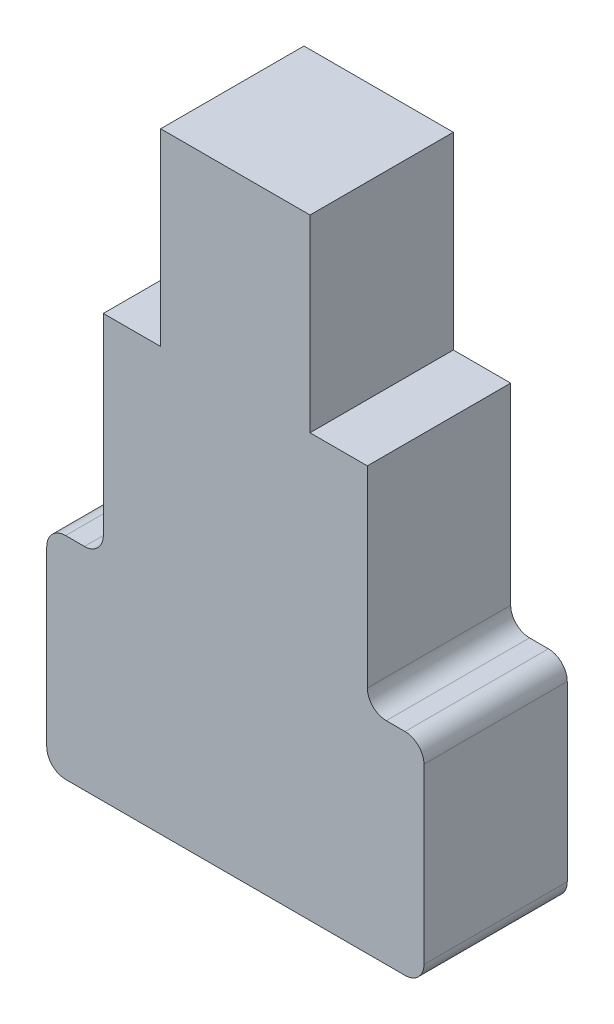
ISO-10303-21;
HEADER;
FILE_DESCRIPTION(('STEP AP214'),'2;1');
FILE_NAME('part.step','',(''),(''),'','','');
FILE_SCHEMA(('AUTOMOTIVE_DESIGN { 1 0 10303 214 1 1 1 1 }'));
ENDSEC;
DATA;
#1=APPLICATION_CONTEXT('core data for automotive mechanical design processes');
#2=APPLICATION_PROTOCOL_DEFINITION('international standard','automotive_design',2000,#1);
#3=PRODUCT_CONTEXT('',#1,'mechanical');
#4=PRODUCT('Part','Part','',(#3));
#5=PRODUCT_RELATED_PRODUCT_CATEGORY('part','',(#4));
#6=PRODUCT_DEFINITION_FORMATION('','',#4);
#7=PRODUCT_DEFINITION_CONTEXT('part definition',#1,'design');
#8=PRODUCT_DEFINITION('design','',#6,#7);
#9=PRODUCT_DEFINITION_SHAPE('','',#8);
#10=(LENGTH_UNIT() NAMED_UNIT(*) SI_UNIT(.MILLI.,.METRE.));
#11=(NAMED_UNIT(*) PLANE_ANGLE_UNIT() SI_UNIT($,.RADIAN.));
#12=(NAMED_UNIT(*) SI_UNIT($,.STERADIAN.) SOLID_ANGLE_UNIT());
#13=UNCERTAINTY_MEASURE_WITH_UNIT(LENGTH_MEASURE(1.E-05),#10,'distance_accuracy_value','');
#14=(GEOMETRIC_REPRESENTATION_CONTEXT(3) GLOBAL_UNCERTAINTY_ASSIGNED_CONTEXT((#13)) GLOBAL_UNIT_ASSIGNED_CONTEXT((#10,
#11,#12)) REPRESENTATION_CONTEXT('',''));
#15=CARTESIAN_POINT('',(0.,0.,0.));
#16=DIRECTION('',(0.,0.,1.));
#17=DIRECTION('',(1.,0.,0.));
#18=AXIS2_PLACEMENT_3D('',#15,#16,#17);
#19=CARTESIAN_POINT('',(-10.02,18.48,9.59));
#20=DIRECTION('',(0.,1.,0.));
#21=DIRECTION('',(0.,0.,1.));
#22=AXIS2_PLACEMENT_3D('',#19,#20,#21);
#23=PLANE('',#22);
#24=DIRECTION('',(0.,0.,-1.));
#25=VECTOR('',#24,1.);
#26=CARTESIAN_POINT('',(-9.77,18.48,9.59));
#27=LINE('',#26,#25);
#28=CARTESIAN_POINT('',(-9.77,18.48,9.59));
#29=VERTEX_POINT('',#28);
#30=CARTESIAN_POINT('',(-9.77,18.48,7.69));
#31=VERTEX_POINT('',#30);
#32=EDGE_CURVE('E80',#29,#31,#27,.T.);
#33=ORIENTED_EDGE('',*,*,#32,.F.);
#34=DIRECTION('',(1.,0.,0.));
#35=VECTOR('',#34,1.);
#36=CARTESIAN_POINT('',(-10.02,18.48,9.59));
#37=LINE('',#36,#35);
#38=CARTESIAN_POINT('',(-9.52,18.48,9.59));
#39=VERTEX_POINT('',#38);
#40=EDGE_CURVE('E76',#29,#39,#37,.T.);
#41=ORIENTED_EDGE('',*,*,#40,.T.);
#42=DIRECTION('',(0.,0.,1.));
#43=VECTOR('',#42,1.);
#44=CARTESIAN_POINT('',(-9.52,18.48,9.59));
#45=LINE('',#44,#43);
#46=CARTESIAN_POINT('',(-9.52,18.48,7.69));
#47=VERTEX_POINT('',#46);
#48=EDGE_CURVE('E192',#39,#47,#45,.F.);
#49=ORIENTED_EDGE('',*,*,#48,.T.);
#50=DIRECTION('',(1.,0.,0.));
#51=VECTOR('',#50,1.);
#52=CARTESIAN_POINT('',(-10.02,18.48,7.69));
#53=LINE('',#52,#51);
#54=EDGE_CURVE('E237',#47,#31,#53,.F.);
#55=ORIENTED_EDGE('',*,*,#54,.T.);
#56=EDGE_LOOP('',(#33,#41,#49,#55));
#57=FACE_BOUND('',#56,.T.);
#58=ADVANCED_FACE('F17',(#57),#23,.T.);
#59=CARTESIAN_POINT('',(-5.77,18.48,9.59));
#60=DIRECTION('',(0.,1.,0.));
#61=DIRECTION('',(0.,0.,1.));
#62=AXIS2_PLACEMENT_3D('',#59,#60,#61);
#63=PLANE('',#62);
#64=DIRECTION('',(0.,0.,1.));
#65=VECTOR('',#64,1.);
#66=CARTESIAN_POINT('',(-5.52,18.48,9.59));
#67=LINE('',#66,#65);
#68=CARTESIAN_POINT('',(-5.52,18.48,7.69));
#69=VERTEX_POINT('',#68);
#70=CARTESIAN_POINT('',(-5.52,18.48,9.59));
#71=VERTEX_POINT('',#70);
#72=EDGE_CURVE('E191',#69,#71,#67,.T.);
#73=ORIENTED_EDGE('',*,*,#72,.T.);
#74=DIRECTION('',(1.,0.,0.));
#75=VECTOR('',#74,1.);
#76=CARTESIAN_POINT('',(-5.77,18.48,9.59));
#77=LINE('',#76,#75);
#78=CARTESIAN_POINT('',(-5.27,18.48,9.59));
#79=VERTEX_POINT('',#78);
#80=EDGE_CURVE('E81',#71,#79,#77,.T.);
#81=ORIENTED_EDGE('',*,*,#80,.T.);
#82=DIRECTION('',(0.,0.,-1.));
#83=VECTOR('',#82,1.);
#84=CARTESIAN_POINT('',(-5.27,18.48,9.59));
#85=LINE('',#84,#83);
#86=CARTESIAN_POINT('',(-5.27,18.48,7.69));
#87=VERTEX_POINT('',#86);
#88=EDGE_CURVE('E198',#87,#79,#85,.F.);
#89=ORIENTED_EDGE('',*,*,#88,.F.);
#90=DIRECTION('',(-1.,0.,0.));
#91=VECTOR('',#90,1.);
#92=CARTESIAN_POINT('',(-7.52,18.48,7.69));
#93=LINE('',#92,#91);
#94=EDGE_CURVE('E158',#69,#87,#93,.F.);
#95=ORIENTED_EDGE('',*,*,#94,.F.);
#96=EDGE_LOOP('',(#73,#81,#89,#95));
#97=FACE_BOUND('',#96,.T.);
#98=ADVANCED_FACE('F325',(#97),#63,.T.);
#99=CARTESIAN_POINT('',(-9.77,18.23,9.59));
#100=DIRECTION('',(0.,0.,-1.));
#101=DIRECTION('',(-1.,0.,0.));
#102=AXIS2_PLACEMENT_3D('',#99,#100,#101);
#103=CYLINDRICAL_SURFACE('',#102,0.25);
#104=CARTESIAN_POINT('',(-9.77,18.23,9.59));
#105=DIRECTION('',(0.,0.,-1.));
#106=DIRECTION('',(-1.,0.,0.));
#107=AXIS2_PLACEMENT_3D('',#104,#105,#106);
#108=CIRCLE('',#107,0.25);
#109=CARTESIAN_POINT('',(-10.02,18.23,9.59));
#110=VERTEX_POINT('',#109);
#111=EDGE_CURVE('E20',#110,#29,#108,.T.);
#112=ORIENTED_EDGE('',*,*,#111,.T.);
#113=ORIENTED_EDGE('',*,*,#32,.T.);
#114=CARTESIAN_POINT('',(-9.77,18.23,7.69));
#115=DIRECTION('',(0.,0.,-1.));
#116=DIRECTION('',(-1.,0.,0.));
#117=AXIS2_PLACEMENT_3D('',#114,#115,#116);
#118=CIRCLE('',#117,0.25);
#119=CARTESIAN_POINT('',(-10.02,18.23,7.69));
#120=VERTEX_POINT('',#119);
#121=EDGE_CURVE('E88',#120,#31,#118,.T.);
#122=ORIENTED_EDGE('',*,*,#121,.F.);
#123=DIRECTION('',(0.,0.,1.));
#124=VECTOR('',#123,1.);
#125=CARTESIAN_POINT('',(-10.02,18.23,9.59));
#126=LINE('',#125,#124);
#127=EDGE_CURVE('E84',#110,#120,#126,.F.);
#128=ORIENTED_EDGE('',*,*,#127,.F.);
#129=EDGE_LOOP('',(#112,#113,#122,#128));
#130=FACE_BOUND('',#129,.T.);
#131=ADVANCED_FACE('F85',(#130),#103,.T.);
#132=CARTESIAN_POINT('',(-9.77,15.93,9.59));
#133=DIRECTION('',(0.,0.,-1.));
#134=DIRECTION('',(-1.,0.,0.));
#135=AXIS2_PLACEMENT_3D('',#132,#133,#134);
#136=CYLINDRICAL_SURFACE('',#135,0.25);
#137=CARTESIAN_POINT('',(-9.77,15.93,9.59));
#138=DIRECTION('',(0.,0.,-1.));
#139=DIRECTION('',(-1.,0.,0.));
#140=AXIS2_PLACEMENT_3D('',#137,#138,#139);
#141=CIRCLE('',#140,0.25);
#142=CARTESIAN_POINT('',(-9.77,15.68,9.59));
#143=VERTEX_POINT('',#142);
#144=CARTESIAN_POINT('',(-10.02,15.93,9.59));
#145=VERTEX_POINT('',#144);
#146=EDGE_CURVE('E226',#143,#145,#141,.T.);
#147=ORIENTED_EDGE('',*,*,#146,.T.);
#148=DIRECTION('',(0.,0.,1.));
#149=VECTOR('',#148,1.);
#150=CARTESIAN_POINT('',(-10.02,15.93,9.59));
#151=LINE('',#150,#149);
#152=CARTESIAN_POINT('',(-10.02,15.93,7.69));
#153=VERTEX_POINT('',#152);
#154=EDGE_CURVE('E98',#153,#145,#151,.T.);
#155=ORIENTED_EDGE('',*,*,#154,.F.);
#156=CARTESIAN_POINT('',(-9.77,15.93,7.69));
#157=DIRECTION('',(0.,0.,-1.));
#158=DIRECTION('',(-1.,0.,0.));
#159=AXIS2_PLACEMENT_3D('',#156,#157,#158);
#160=CIRCLE('',#159,0.25);
#161=CARTESIAN_POINT('',(-9.77,15.68,7.69));
#162=VERTEX_POINT('',#161);
#163=EDGE_CURVE('E251',#162,#153,#160,.T.);
#164=ORIENTED_EDGE('',*,*,#163,.F.);
#165=DIRECTION('',(0.,0.,-1.));
#166=VECTOR('',#165,1.);
#167=CARTESIAN_POINT('',(-9.77,15.68,9.59));
#168=LINE('',#167,#166);
#169=EDGE_CURVE('E152',#143,#162,#168,.T.);
#170=ORIENTED_EDGE('',*,*,#169,.F.);
#171=EDGE_LOOP('',(#147,#155,#164,#170));
#172=FACE_BOUND('',#171,.T.);
#173=ADVANCED_FACE('F258',(#172),#136,.T.);
#174=CARTESIAN_POINT('',(-9.52,18.73,9.59));
#175=DIRECTION('',(0.,0.,1.));
#176=DIRECTION('',(1.,0.,0.));
#177=AXIS2_PLACEMENT_3D('',#174,#175,#176);
#178=CYLINDRICAL_SURFACE('',#177,0.25);
#179=ORIENTED_EDGE('',*,*,#48,.F.);
#180=CARTESIAN_POINT('',(-9.52,18.73,9.59));
#181=DIRECTION('',(0.,0.,1.));
#182=DIRECTION('',(1.,0.,0.));
#183=AXIS2_PLACEMENT_3D('',#180,#181,#182);
#184=CIRCLE('',#183,0.25);
#185=CARTESIAN_POINT('',(-9.27,18.73,9.59));
#186=VERTEX_POINT('',#185);
#187=EDGE_CURVE('E224',#186,#39,#184,.F.);
#188=ORIENTED_EDGE('',*,*,#187,.F.);
#189=DIRECTION('',(0.,0.,1.));
#190=VECTOR('',#189,1.);
#191=CARTESIAN_POINT('',(-9.27,18.73,9.59));
#192=LINE('',#191,#190);
#193=CARTESIAN_POINT('',(-9.27,18.73,7.69));
#194=VERTEX_POINT('',#193);
#195=EDGE_CURVE('E138',#194,#186,#192,.T.);
#196=ORIENTED_EDGE('',*,*,#195,.F.);
#197=CARTESIAN_POINT('',(-9.52,18.73,7.69));
#198=DIRECTION('',(0.,0.,1.));
#199=DIRECTION('',(1.,0.,0.));
#200=AXIS2_PLACEMENT_3D('',#197,#198,#199);
#201=CIRCLE('',#200,0.25);
#202=EDGE_CURVE('E185',#47,#194,#201,.T.);
#203=ORIENTED_EDGE('',*,*,#202,.F.);
#204=EDGE_LOOP('',(#179,#188,#196,#203));
#205=FACE_BOUND('',#204,.T.);
#206=ADVANCED_FACE('F405',(#205),#178,.F.);
#207=CARTESIAN_POINT('',(-9.27,21.28,9.59));
#208=DIRECTION('',(0.,1.,0.));
#209=DIRECTION('',(0.,0.,1.));
#210=AXIS2_PLACEMENT_3D('',#207,#208,#209);
#211=PLANE('',#210);
#212=DIRECTION('',(0.,0.,1.));
#213=VECTOR('',#212,1.);
#214=CARTESIAN_POINT('',(-9.27,21.28,9.59));
#215=LINE('',#214,#213);
#216=CARTESIAN_POINT('',(-9.27,21.28,9.59));
#217=VERTEX_POINT('',#216);
#218=CARTESIAN_POINT('',(-9.27,21.28,7.69));
#219=VERTEX_POINT('',#218);
#220=EDGE_CURVE('E143',#217,#219,#215,.F.);
#221=ORIENTED_EDGE('',*,*,#220,.F.);
#222=DIRECTION('',(1.,0.,0.));
#223=VECTOR('',#222,1.);
#224=CARTESIAN_POINT('',(-9.27,21.28,9.59));
#225=LINE('',#224,#223);
#226=CARTESIAN_POINT('',(-8.51,21.28,9.59));
#227=VERTEX_POINT('',#226);
#228=EDGE_CURVE('E188',#217,#227,#225,.T.);
#229=ORIENTED_EDGE('',*,*,#228,.T.);
#230=DIRECTION('',(0.,0.,1.));
#231=VECTOR('',#230,1.);
#232=CARTESIAN_POINT('',(-8.51,21.28,9.59));
#233=LINE('',#232,#231);
#234=CARTESIAN_POINT('',(-8.51,21.28,7.69));
#235=VERTEX_POINT('',#234);
#236=EDGE_CURVE('E137',#235,#227,#233,.T.);
#237=ORIENTED_EDGE('',*,*,#236,.F.);
#238=DIRECTION('',(-1.,0.,0.));
#239=VECTOR('',#238,1.);
#240=CARTESIAN_POINT('',(-7.52,21.28,7.69));
#241=LINE('',#240,#239);
#242=EDGE_CURVE('E176',#219,#235,#241,.F.);
#243=ORIENTED_EDGE('',*,*,#242,.F.);
#244=EDGE_LOOP('',(#221,#229,#237,#243));
#245=FACE_BOUND('',#244,.T.);
#246=ADVANCED_FACE('F355',(#245),#211,.T.);
#247=CARTESIAN_POINT('',(-5.52,18.73,9.59));
#248=DIRECTION('',(0.,0.,1.));
#249=DIRECTION('',(1.,0.,0.));
#250=AXIS2_PLACEMENT_3D('',#247,#248,#249);
#251=CYLINDRICAL_SURFACE('',#250,0.25);
#252=DIRECTION('',(0.,0.,-1.));
#253=VECTOR('',#252,1.);
#254=CARTESIAN_POINT('',(-5.77,18.73,9.59));
#255=LINE('',#254,#253);
#256=CARTESIAN_POINT('',(-5.77,18.73,9.59));
#257=VERTEX_POINT('',#256);
#258=CARTESIAN_POINT('',(-5.77,18.73,7.69));
#259=VERTEX_POINT('',#258);
#260=EDGE_CURVE('E118',#257,#259,#255,.T.);
#261=ORIENTED_EDGE('',*,*,#260,.F.);
#262=CARTESIAN_POINT('',(-5.52,18.73,9.59));
#263=DIRECTION('',(0.,0.,1.));
#264=DIRECTION('',(1.,0.,0.));
#265=AXIS2_PLACEMENT_3D('',#262,#263,#264);
#266=CIRCLE('',#265,0.25);
#267=EDGE_CURVE('E166',#71,#257,#266,.F.);
#268=ORIENTED_EDGE('',*,*,#267,.F.);
#269=ORIENTED_EDGE('',*,*,#72,.F.);
#270=CARTESIAN_POINT('',(-5.52,18.73,7.69));
#271=DIRECTION('',(0.,0.,1.));
#272=DIRECTION('',(1.,0.,0.));
#273=AXIS2_PLACEMENT_3D('',#270,#271,#272);
#274=CIRCLE('',#273,0.25);
#275=EDGE_CURVE('E162',#259,#69,#274,.T.);
#276=ORIENTED_EDGE('',*,*,#275,.F.);
#277=EDGE_LOOP('',(#261,#268,#269,#276));
#278=FACE_BOUND('',#277,.T.);
#279=ADVANCED_FACE('F330',(#278),#251,.F.);
#280=CARTESIAN_POINT('',(-6.53,21.28,9.59));
#281=DIRECTION('',(0.,1.,0.));
#282=DIRECTION('',(0.,0.,1.));
#283=AXIS2_PLACEMENT_3D('',#280,#281,#282);
#284=PLANE('',#283);
#285=DIRECTION('',(0.,0.,-1.));
#286=VECTOR('',#285,1.);
#287=CARTESIAN_POINT('',(-6.53,21.28,9.59));
#288=LINE('',#287,#286);
#289=CARTESIAN_POINT('',(-6.53,21.28,9.59));
#290=VERTEX_POINT('',#289);
#291=CARTESIAN_POINT('',(-6.53,21.28,7.69));
#292=VERTEX_POINT('',#291);
#293=EDGE_CURVE('E133',#290,#292,#288,.T.);
#294=ORIENTED_EDGE('',*,*,#293,.F.);
#295=DIRECTION('',(1.,0.,0.));
#296=VECTOR('',#295,1.);
#297=CARTESIAN_POINT('',(-6.53,21.28,9.59));
#298=LINE('',#297,#296);
#299=CARTESIAN_POINT('',(-5.77,21.28,9.59));
#300=VERTEX_POINT('',#299);
#301=EDGE_CURVE('E163',#290,#300,#298,.T.);
#302=ORIENTED_EDGE('',*,*,#301,.T.);
#303=DIRECTION('',(0.,0.,-1.));
#304=VECTOR('',#303,1.);
#305=CARTESIAN_POINT('',(-5.77,21.28,9.59));
#306=LINE('',#305,#304);
#307=CARTESIAN_POINT('',(-5.77,21.28,7.69));
#308=VERTEX_POINT('',#307);
#309=EDGE_CURVE('E117',#308,#300,#306,.F.);
#310=ORIENTED_EDGE('',*,*,#309,.F.);
#311=DIRECTION('',(-1.,0.,0.));
#312=VECTOR('',#311,1.);
#313=CARTESIAN_POINT('',(-7.52,21.28,7.69));
#314=LINE('',#313,#312);
#315=EDGE_CURVE('E173',#292,#308,#314,.F.);
#316=ORIENTED_EDGE('',*,*,#315,.F.);
#317=EDGE_LOOP('',(#294,#302,#310,#316));
#318=FACE_BOUND('',#317,.T.);
#319=ADVANCED_FACE('F397',(#318),#284,.T.);
#320=CARTESIAN_POINT('',(-5.27,15.93,9.59));
#321=DIRECTION('',(0.,0.,-1.));
#322=DIRECTION('',(-1.,0.,0.));
#323=AXIS2_PLACEMENT_3D('',#320,#321,#322);
#324=CYLINDRICAL_SURFACE('',#323,0.25);
#325=CARTESIAN_POINT('',(-5.27,15.93,9.59));
#326=DIRECTION('',(0.,0.,-1.));
#327=DIRECTION('',(-1.,0.,0.));
#328=AXIS2_PLACEMENT_3D('',#325,#326,#327);
#329=CIRCLE('',#328,0.25);
#330=CARTESIAN_POINT('',(-5.02,15.93,9.59));
#331=VERTEX_POINT('',#330);
#332=CARTESIAN_POINT('',(-5.27,15.68,9.59));
#333=VERTEX_POINT('',#332);
#334=EDGE_CURVE('E35',#331,#333,#329,.T.);
#335=ORIENTED_EDGE('',*,*,#334,.T.);
#336=DIRECTION('',(0.,0.,-1.));
#337=VECTOR('',#336,1.);
#338=CARTESIAN_POINT('',(-5.27,15.68,9.59));
#339=LINE('',#338,#337);
#340=CARTESIAN_POINT('',(-5.27,15.68,7.69));
#341=VERTEX_POINT('',#340);
#342=EDGE_CURVE('E93',#341,#333,#339,.F.);
#343=ORIENTED_EDGE('',*,*,#342,.F.);
#344=CARTESIAN_POINT('',(-5.27,15.93,7.69));
#345=DIRECTION('',(0.,0.,-1.));
#346=DIRECTION('',(-1.,0.,0.));
#347=AXIS2_PLACEMENT_3D('',#344,#345,#346);
#348=CIRCLE('',#347,0.25);
#349=CARTESIAN_POINT('',(-5.02,15.93,7.69));
#350=VERTEX_POINT('',#349);
#351=EDGE_CURVE('E161',#350,#341,#348,.T.);
#352=ORIENTED_EDGE('',*,*,#351,.F.);
#353=DIRECTION('',(0.,0.,-1.));
#354=VECTOR('',#353,1.);
#355=CARTESIAN_POINT('',(-5.02,15.93,9.59));
#356=LINE('',#355,#354);
#357=EDGE_CURVE('E114',#331,#350,#356,.T.);
#358=ORIENTED_EDGE('',*,*,#357,.F.);
#359=EDGE_LOOP('',(#335,#343,#352,#358));
#360=FACE_BOUND('',#359,.T.);
#361=ADVANCED_FACE('F268',(#360),#324,.T.);
#362=CARTESIAN_POINT('',(-7.52,15.68,7.69));
#363=DIRECTION('',(0.,0.,-1.));
#364=DIRECTION('',(-1.,0.,0.));
#365=AXIS2_PLACEMENT_3D('',#362,#363,#364);
#366=PLANE('',#365);
#367=ORIENTED_EDGE('',*,*,#351,.T.);
#368=DIRECTION('',(1.,0.,0.));
#369=VECTOR('',#368,1.);
#370=CARTESIAN_POINT('',(-5.02,15.68,7.69));
#371=LINE('',#370,#369);
#372=EDGE_CURVE('E151',#162,#341,#371,.T.);
#373=ORIENTED_EDGE('',*,*,#372,.F.);
#374=ORIENTED_EDGE('',*,*,#163,.T.);
#375=DIRECTION('',(0.,1.,0.));
#376=VECTOR('',#375,1.);
#377=CARTESIAN_POINT('',(-10.02,15.68,7.69));
#378=LINE('',#377,#376);
#379=EDGE_CURVE('E92',#120,#153,#378,.F.);
#380=ORIENTED_EDGE('',*,*,#379,.F.);
#381=ORIENTED_EDGE('',*,*,#121,.T.);
#382=ORIENTED_EDGE('',*,*,#54,.F.);
#383=ORIENTED_EDGE('',*,*,#202,.T.);
#384=DIRECTION('',(0.,1.,0.));
#385=VECTOR('',#384,1.);
#386=CARTESIAN_POINT('',(-9.27,18.48,7.69));
#387=LINE('',#386,#385);
#388=EDGE_CURVE('E142',#219,#194,#387,.F.);
#389=ORIENTED_EDGE('',*,*,#388,.F.);
#390=ORIENTED_EDGE('',*,*,#242,.T.);
#391=DIRECTION('',(0.,1.,0.));
#392=VECTOR('',#391,1.);
#393=CARTESIAN_POINT('',(-8.51,21.28,7.69));
#394=LINE('',#393,#392);
#395=CARTESIAN_POINT('',(-8.51,23.78,7.69));
#396=VERTEX_POINT('',#395);
#397=EDGE_CURVE('E141',#396,#235,#394,.F.);
#398=ORIENTED_EDGE('',*,*,#397,.F.);
#399=DIRECTION('',(1.,0.,0.));
#400=VECTOR('',#399,1.);
#401=CARTESIAN_POINT('',(-8.51,23.78,7.69));
#402=LINE('',#401,#400);
#403=CARTESIAN_POINT('',(-6.53,23.78,7.69));
#404=VERTEX_POINT('',#403);
#405=EDGE_CURVE('E134',#404,#396,#402,.F.);
#406=ORIENTED_EDGE('',*,*,#405,.F.);
#407=DIRECTION('',(0.,1.,0.));
#408=VECTOR('',#407,1.);
#409=CARTESIAN_POINT('',(-6.53,23.78,7.69));
#410=LINE('',#409,#408);
#411=EDGE_CURVE('E129',#292,#404,#410,.T.);
#412=ORIENTED_EDGE('',*,*,#411,.F.);
#413=ORIENTED_EDGE('',*,*,#315,.T.);
#414=DIRECTION('',(0.,1.,0.));
#415=VECTOR('',#414,1.);
#416=CARTESIAN_POINT('',(-5.77,21.28,7.69));
#417=LINE('',#416,#415);
#418=EDGE_CURVE('E121',#259,#308,#417,.T.);
#419=ORIENTED_EDGE('',*,*,#418,.F.);
#420=ORIENTED_EDGE('',*,*,#275,.T.);
#421=ORIENTED_EDGE('',*,*,#94,.T.);
#422=CARTESIAN_POINT('',(-5.27,18.23,7.69));
#423=DIRECTION('',(0.,0.,-1.));
#424=DIRECTION('',(-1.,0.,0.));
#425=AXIS2_PLACEMENT_3D('',#422,#423,#424);
#426=CIRCLE('',#425,0.25);
#427=CARTESIAN_POINT('',(-5.02,18.23,7.69));
#428=VERTEX_POINT('',#427);
#429=EDGE_CURVE('E201',#428,#87,#426,.F.);
#430=ORIENTED_EDGE('',*,*,#429,.F.);
#431=DIRECTION('',(0.,1.,0.));
#432=VECTOR('',#431,1.);
#433=CARTESIAN_POINT('',(-5.02,18.48,7.69));
#434=LINE('',#433,#432);
#435=EDGE_CURVE('E113',#350,#428,#434,.T.);
#436=ORIENTED_EDGE('',*,*,#435,.F.);
#437=EDGE_LOOP('',(#367,#373,#374,#380,#381,#382,#383,#389,#390,#398,#406,#412,#413,#419,#420,
#421,#430,#436));
#438=FACE_BOUND('',#437,.T.);
#439=ADVANCED_FACE('F296',(#438),#366,.T.);
#440=CARTESIAN_POINT('',(-5.27,18.23,9.59));
#441=DIRECTION('',(0.,0.,-1.));
#442=DIRECTION('',(-1.,0.,0.));
#443=AXIS2_PLACEMENT_3D('',#440,#441,#442);
#444=CYLINDRICAL_SURFACE('',#443,0.25);
#445=CARTESIAN_POINT('',(-5.27,18.23,9.59));
#446=DIRECTION('',(0.,0.,-1.));
#447=DIRECTION('',(-1.,0.,0.));
#448=AXIS2_PLACEMENT_3D('',#445,#446,#447);
#449=CIRCLE('',#448,0.25);
#450=CARTESIAN_POINT('',(-5.02,18.23,9.59));
#451=VERTEX_POINT('',#450);
#452=EDGE_CURVE('E155',#79,#451,#449,.T.);
#453=ORIENTED_EDGE('',*,*,#452,.T.);
#454=DIRECTION('',(0.,0.,-1.));
#455=VECTOR('',#454,1.);
#456=CARTESIAN_POINT('',(-5.02,18.23,9.59));
#457=LINE('',#456,#455);
#458=EDGE_CURVE('E106',#428,#451,#457,.F.);
#459=ORIENTED_EDGE('',*,*,#458,.F.);
#460=ORIENTED_EDGE('',*,*,#429,.T.);
#461=ORIENTED_EDGE('',*,*,#88,.T.);
#462=EDGE_LOOP('',(#453,#459,#460,#461));
#463=FACE_BOUND('',#462,.T.);
#464=ADVANCED_FACE('F323',(#463),#444,.T.);
#465=CARTESIAN_POINT('',(-5.02,15.68,9.59));
#466=DIRECTION('',(0.,-1.,0.));
#467=DIRECTION('',(0.,0.,-1.));
#468=AXIS2_PLACEMENT_3D('',#465,#466,#467);
#469=PLANE('',#468);
#470=ORIENTED_EDGE('',*,*,#342,.T.);
#471=DIRECTION('',(-1.,0.,0.));
#472=VECTOR('',#471,1.);
#473=CARTESIAN_POINT('',(-7.52,15.68,9.59));
#474=LINE('',#473,#472);
#475=EDGE_CURVE('E100',#333,#143,#474,.T.);
#476=ORIENTED_EDGE('',*,*,#475,.T.);
#477=ORIENTED_EDGE('',*,*,#169,.T.);
#478=ORIENTED_EDGE('',*,*,#372,.T.);
#479=EDGE_LOOP('',(#470,#476,#477,#478));
#480=FACE_BOUND('',#479,.T.);
#481=ADVANCED_FACE('F261',(#480),#469,.T.);
#482=CARTESIAN_POINT('',(-10.02,15.68,9.59));
#483=DIRECTION('',(-1.,0.,0.));
#484=DIRECTION('',(0.,0.,1.));
#485=AXIS2_PLACEMENT_3D('',#482,#483,#484);
#486=PLANE('',#485);
#487=ORIENTED_EDGE('',*,*,#154,.T.);
#488=DIRECTION('',(0.,1.,0.));
#489=VECTOR('',#488,1.);
#490=CARTESIAN_POINT('',(-10.02,15.68,9.59));
#491=LINE('',#490,#489);
#492=EDGE_CURVE('E74',#145,#110,#491,.T.);
#493=ORIENTED_EDGE('',*,*,#492,.T.);
#494=ORIENTED_EDGE('',*,*,#127,.T.);
#495=ORIENTED_EDGE('',*,*,#379,.T.);
#496=EDGE_LOOP('',(#487,#493,#494,#495));
#497=FACE_BOUND('',#496,.T.);
#498=ADVANCED_FACE('F96',(#497),#486,.T.);
#499=CARTESIAN_POINT('',(-9.27,18.48,9.59));
#500=DIRECTION('',(-1.,0.,0.));
#501=DIRECTION('',(0.,0.,1.));
#502=AXIS2_PLACEMENT_3D('',#499,#500,#501);
#503=PLANE('',#502);
#504=ORIENTED_EDGE('',*,*,#195,.T.);
#505=DIRECTION('',(0.,1.,0.));
#506=VECTOR('',#505,1.);
#507=CARTESIAN_POINT('',(-9.27,15.68,9.59));
#508=LINE('',#507,#506);
#509=EDGE_CURVE('E99',#186,#217,#508,.T.);
#510=ORIENTED_EDGE('',*,*,#509,.T.);
#511=ORIENTED_EDGE('',*,*,#220,.T.);
#512=ORIENTED_EDGE('',*,*,#388,.T.);
#513=EDGE_LOOP('',(#504,#510,#511,#512));
#514=FACE_BOUND('',#513,.T.);
#515=ADVANCED_FACE('F384',(#514),#503,.T.);
#516=CARTESIAN_POINT('',(-8.51,21.28,9.59));
#517=DIRECTION('',(-1.,0.,0.));
#518=DIRECTION('',(0.,0.,1.));
#519=AXIS2_PLACEMENT_3D('',#516,#517,#518);
#520=PLANE('',#519);
#521=ORIENTED_EDGE('',*,*,#236,.T.);
#522=DIRECTION('',(0.,1.,0.));
#523=VECTOR('',#522,1.);
#524=CARTESIAN_POINT('',(-8.51,15.68,9.59));
#525=LINE('',#524,#523);
#526=CARTESIAN_POINT('',(-8.51,23.78,9.59));
#527=VERTEX_POINT('',#526);
#528=EDGE_CURVE('E103',#227,#527,#525,.T.);
#529=ORIENTED_EDGE('',*,*,#528,.T.);
#530=DIRECTION('',(0.,0.,1.));
#531=VECTOR('',#530,1.);
#532=CARTESIAN_POINT('',(-8.51,23.78,9.59));
#533=LINE('',#532,#531);
#534=EDGE_CURVE('E130',#396,#527,#533,.T.);
#535=ORIENTED_EDGE('',*,*,#534,.F.);
#536=ORIENTED_EDGE('',*,*,#397,.T.);
#537=EDGE_LOOP('',(#521,#529,#535,#536));
#538=FACE_BOUND('',#537,.T.);
#539=ADVANCED_FACE('F350',(#538),#520,.T.);
#540=CARTESIAN_POINT('',(-8.51,23.78,9.59));
#541=DIRECTION('',(0.,1.,0.));
#542=DIRECTION('',(0.,0.,1.));
#543=AXIS2_PLACEMENT_3D('',#540,#541,#542);
#544=PLANE('',#543);
#545=ORIENTED_EDGE('',*,*,#534,.T.);
#546=DIRECTION('',(-1.,0.,0.));
#547=VECTOR('',#546,1.);
#548=CARTESIAN_POINT('',(-7.52,23.78,9.59));
#549=LINE('',#548,#547);
#550=CARTESIAN_POINT('',(-6.53,23.78,9.59));
#551=VERTEX_POINT('',#550);
#552=EDGE_CURVE('E230',#527,#551,#549,.F.);
#553=ORIENTED_EDGE('',*,*,#552,.T.);
#554=DIRECTION('',(0.,0.,-1.));
#555=VECTOR('',#554,1.);
#556=CARTESIAN_POINT('',(-6.53,23.78,9.59));
#557=LINE('',#556,#555);
#558=EDGE_CURVE('E122',#404,#551,#557,.F.);
#559=ORIENTED_EDGE('',*,*,#558,.F.);
#560=ORIENTED_EDGE('',*,*,#405,.T.);
#561=EDGE_LOOP('',(#545,#553,#559,#560));
#562=FACE_BOUND('',#561,.T.);
#563=ADVANCED_FACE('F343',(#562),#544,.T.);
#564=CARTESIAN_POINT('',(-6.53,23.78,9.59));
#565=DIRECTION('',(1.,0.,0.));
#566=DIRECTION('',(0.,0.,-1.));
#567=AXIS2_PLACEMENT_3D('',#564,#565,#566);
#568=PLANE('',#567);
#569=ORIENTED_EDGE('',*,*,#558,.T.);
#570=DIRECTION('',(0.,1.,0.));
#571=VECTOR('',#570,1.);
#572=CARTESIAN_POINT('',(-6.53,15.68,9.59));
#573=LINE('',#572,#571);
#574=EDGE_CURVE('E227',#551,#290,#573,.F.);
#575=ORIENTED_EDGE('',*,*,#574,.T.);
#576=ORIENTED_EDGE('',*,*,#293,.T.);
#577=ORIENTED_EDGE('',*,*,#411,.T.);
#578=EDGE_LOOP('',(#569,#575,#576,#577));
#579=FACE_BOUND('',#578,.T.);
#580=ADVANCED_FACE('F374',(#579),#568,.T.);
#581=CARTESIAN_POINT('',(-5.77,21.28,9.59));
#582=DIRECTION('',(1.,0.,0.));
#583=DIRECTION('',(0.,0.,-1.));
#584=AXIS2_PLACEMENT_3D('',#581,#582,#583);
#585=PLANE('',#584);
#586=ORIENTED_EDGE('',*,*,#309,.T.);
#587=DIRECTION('',(0.,1.,0.));
#588=VECTOR('',#587,1.);
#589=CARTESIAN_POINT('',(-5.77,15.68,9.59));
#590=LINE('',#589,#588);
#591=EDGE_CURVE('E26',#300,#257,#590,.F.);
#592=ORIENTED_EDGE('',*,*,#591,.T.);
#593=ORIENTED_EDGE('',*,*,#260,.T.);
#594=ORIENTED_EDGE('',*,*,#418,.T.);
#595=EDGE_LOOP('',(#586,#592,#593,#594));
#596=FACE_BOUND('',#595,.T.);
#597=ADVANCED_FACE('F333',(#596),#585,.T.);
#598=CARTESIAN_POINT('',(-5.02,18.48,9.59));
#599=DIRECTION('',(1.,0.,0.));
#600=DIRECTION('',(0.,0.,-1.));
#601=AXIS2_PLACEMENT_3D('',#598,#599,#600);
#602=PLANE('',#601);
#603=ORIENTED_EDGE('',*,*,#458,.T.);
#604=DIRECTION('',(0.,1.,0.));
#605=VECTOR('',#604,1.);
#606=CARTESIAN_POINT('',(-5.02,15.68,9.59));
#607=LINE('',#606,#605);
#608=EDGE_CURVE('E11',#451,#331,#607,.F.);
#609=ORIENTED_EDGE('',*,*,#608,.T.);
#610=ORIENTED_EDGE('',*,*,#357,.T.);
#611=ORIENTED_EDGE('',*,*,#435,.T.);
#612=EDGE_LOOP('',(#603,#609,#610,#611));
#613=FACE_BOUND('',#612,.T.);
#614=ADVANCED_FACE('F365',(#613),#602,.T.);
#615=CARTESIAN_POINT('',(-7.52,15.68,9.59));
#616=DIRECTION('',(0.,0.,-1.));
#617=DIRECTION('',(-1.,0.,0.));
#618=AXIS2_PLACEMENT_3D('',#615,#616,#617);
#619=PLANE('',#618);
#620=ORIENTED_EDGE('',*,*,#608,.F.);
#621=ORIENTED_EDGE('',*,*,#452,.F.);
#622=ORIENTED_EDGE('',*,*,#80,.F.);
#623=ORIENTED_EDGE('',*,*,#267,.T.);
#624=ORIENTED_EDGE('',*,*,#591,.F.);
#625=ORIENTED_EDGE('',*,*,#301,.F.);
#626=ORIENTED_EDGE('',*,*,#574,.F.);
#627=ORIENTED_EDGE('',*,*,#552,.F.);
#628=ORIENTED_EDGE('',*,*,#528,.F.);
#629=ORIENTED_EDGE('',*,*,#228,.F.);
#630=ORIENTED_EDGE('',*,*,#509,.F.);
#631=ORIENTED_EDGE('',*,*,#187,.T.);
#632=ORIENTED_EDGE('',*,*,#40,.F.);
#633=ORIENTED_EDGE('',*,*,#111,.F.);
#634=ORIENTED_EDGE('',*,*,#492,.F.);
#635=ORIENTED_EDGE('',*,*,#146,.F.);
#636=ORIENTED_EDGE('',*,*,#475,.F.);
#637=ORIENTED_EDGE('',*,*,#334,.F.);
#638=EDGE_LOOP('',(#620,#621,#622,#623,#624,#625,#626,#627,#628,#629,#630,#631,#632,#633,#634,
#635,#636,#637));
#639=FACE_BOUND('',#638,.T.);
#640=ADVANCED_FACE('F72',(#639),#619,.F.);
#641=CLOSED_SHELL('',(#58,#98,#131,#173,#206,#246,#279,#319,#361,#439,#464,#481,#498,#515,#539,
#563,#580,#597,#614,#640));
#642=MANIFOLD_SOLID_BREP('B1',#641);
#643=ADVANCED_BREP_SHAPE_REPRESENTATION('',(#18,#642),#14);
#644=SHAPE_DEFINITION_REPRESENTATION(#9,#643);
ENDSEC;
END-ISO-10303-21;
